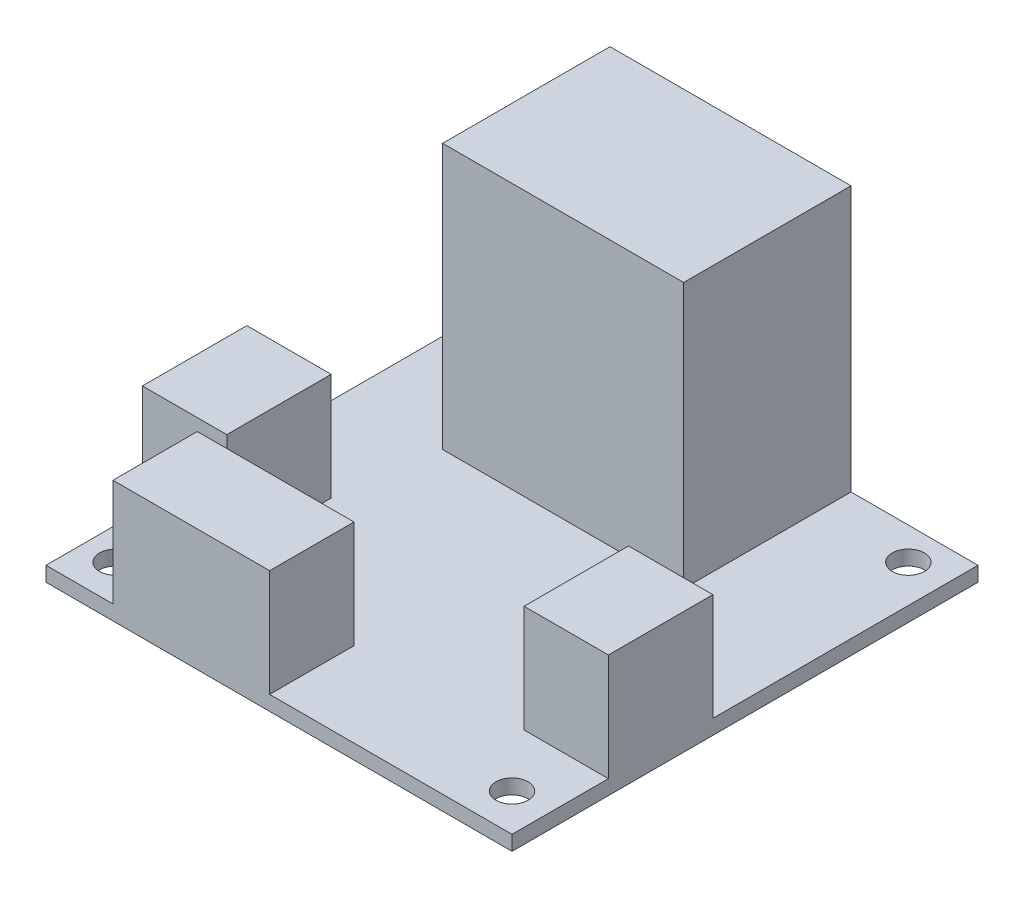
ISO-10303-21;
HEADER;
FILE_DESCRIPTION(('STEP AP214'),'2;1');
FILE_NAME('part.step','',(''),(''),'','','');
FILE_SCHEMA(('AUTOMOTIVE_DESIGN { 1 0 10303 214 1 1 1 1 }'));
ENDSEC;
DATA;
#1=APPLICATION_CONTEXT('core data for automotive mechanical design processes');
#2=APPLICATION_PROTOCOL_DEFINITION('international standard','automotive_design',2000,#1);
#3=PRODUCT_CONTEXT('',#1,'mechanical');
#4=PRODUCT('Part','Part','',(#3));
#5=PRODUCT_RELATED_PRODUCT_CATEGORY('part','',(#4));
#6=PRODUCT_DEFINITION_FORMATION('','',#4);
#7=PRODUCT_DEFINITION_CONTEXT('part definition',#1,'design');
#8=PRODUCT_DEFINITION('design','',#6,#7);
#9=PRODUCT_DEFINITION_SHAPE('','',#8);
#10=(LENGTH_UNIT() NAMED_UNIT(*) SI_UNIT(.MILLI.,.METRE.));
#11=(NAMED_UNIT(*) PLANE_ANGLE_UNIT() SI_UNIT($,.RADIAN.));
#12=(NAMED_UNIT(*) SI_UNIT($,.STERADIAN.) SOLID_ANGLE_UNIT());
#13=UNCERTAINTY_MEASURE_WITH_UNIT(LENGTH_MEASURE(1.E-05),#10,'distance_accuracy_value','');
#14=(GEOMETRIC_REPRESENTATION_CONTEXT(3) GLOBAL_UNCERTAINTY_ASSIGNED_CONTEXT((#13)) GLOBAL_UNIT_ASSIGNED_CONTEXT((#10,
#11,#12)) REPRESENTATION_CONTEXT('',''));
#15=CARTESIAN_POINT('',(0.,0.,0.));
#16=DIRECTION('',(0.,0.,1.));
#17=DIRECTION('',(1.,0.,0.));
#18=AXIS2_PLACEMENT_3D('',#15,#16,#17);
#19=CARTESIAN_POINT('',(0.,1.397,0.));
#20=DIRECTION('',(0.,-1.,0.));
#21=DIRECTION('',(0.,0.,-1.));
#22=AXIS2_PLACEMENT_3D('',#19,#20,#21);
#23=PLANE('',#22);
#24=CARTESIAN_POINT('',(3.048,1.397,-41.148));
#25=DIRECTION('',(0.,1.,0.));
#26=DIRECTION('',(0.,0.,1.));
#27=AXIS2_PLACEMENT_3D('',#24,#25,#26);
#28=CIRCLE('',#27,1.524);
#29=CARTESIAN_POINT('',(3.048,1.397,-39.624));
#30=VERTEX_POINT('',#29);
#31=EDGE_CURVE('E305',#30,#30,#28,.T.);
#32=ORIENTED_EDGE('',*,*,#31,.F.);
#33=EDGE_LOOP('',(#32));
#34=FACE_BOUND('',#33,.T.);
#35=CARTESIAN_POINT('',(40.64,1.397,-41.148));
#36=DIRECTION('',(0.,1.,0.));
#37=DIRECTION('',(0.,0.,1.));
#38=AXIS2_PLACEMENT_3D('',#35,#36,#37);
#39=CIRCLE('',#38,1.524);
#40=CARTESIAN_POINT('',(40.64,1.397,-39.624));
#41=VERTEX_POINT('',#40);
#42=EDGE_CURVE('E299',#41,#41,#39,.T.);
#43=ORIENTED_EDGE('',*,*,#42,.F.);
#44=EDGE_LOOP('',(#43));
#45=FACE_BOUND('',#44,.T.);
#46=CARTESIAN_POINT('',(40.6400000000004,1.397,-3.556));
#47=DIRECTION('',(0.,1.,0.));
#48=DIRECTION('',(0.,0.,1.));
#49=AXIS2_PLACEMENT_3D('',#46,#47,#48);
#50=CIRCLE('',#49,1.524);
#51=CARTESIAN_POINT('',(40.6400000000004,1.397,-2.032));
#52=VERTEX_POINT('',#51);
#53=EDGE_CURVE('E293',#52,#52,#50,.T.);
#54=ORIENTED_EDGE('',*,*,#53,.F.);
#55=EDGE_LOOP('',(#54));
#56=FACE_BOUND('',#55,.T.);
#57=CARTESIAN_POINT('',(3.04800000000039,1.397,-3.556));
#58=DIRECTION('',(0.,1.,0.));
#59=DIRECTION('',(0.,0.,1.));
#60=AXIS2_PLACEMENT_3D('',#57,#58,#59);
#61=CIRCLE('',#60,1.524);
#62=CARTESIAN_POINT('',(3.04800000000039,1.397,-2.032));
#63=VERTEX_POINT('',#62);
#64=EDGE_CURVE('E287',#63,#63,#61,.T.);
#65=ORIENTED_EDGE('',*,*,#64,.F.);
#66=EDGE_LOOP('',(#65));
#67=FACE_BOUND('',#66,.T.);
#68=DIRECTION('',(-1.,0.,0.));
#69=VECTOR('',#68,1.);
#70=CARTESIAN_POINT('',(44.196,1.397,-19.05));
#71=LINE('',#70,#69);
#72=CARTESIAN_POINT('',(44.196,1.397,-19.05));
#73=VERTEX_POINT('',#72);
#74=CARTESIAN_POINT('',(36.195,1.397,-19.05));
#75=VERTEX_POINT('',#74);
#76=EDGE_CURVE('E393',#73,#75,#71,.T.);
#77=ORIENTED_EDGE('',*,*,#76,.F.);
#78=DIRECTION('',(0.,0.,-1.));
#79=VECTOR('',#78,1.);
#80=CARTESIAN_POINT('',(44.196,1.397,0.));
#81=LINE('',#80,#79);
#82=CARTESIAN_POINT('',(44.196,1.397,-44.196));
#83=VERTEX_POINT('',#82);
#84=EDGE_CURVE('E190',#73,#83,#81,.T.);
#85=ORIENTED_EDGE('',*,*,#84,.T.);
#86=DIRECTION('',(-1.,0.,0.));
#87=VECTOR('',#86,1.);
#88=CARTESIAN_POINT('',(0.,1.397,-44.196));
#89=LINE('',#88,#87);
#90=CARTESIAN_POINT('',(32.1552964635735,1.397,-44.196));
#91=VERTEX_POINT('',#90);
#92=EDGE_CURVE('E320',#83,#91,#89,.T.);
#93=ORIENTED_EDGE('',*,*,#92,.T.);
#94=DIRECTION('',(0.,0.,-1.));
#95=VECTOR('',#94,1.);
#96=CARTESIAN_POINT('',(32.1552964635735,1.397,-44.196));
#97=LINE('',#96,#95);
#98=CARTESIAN_POINT('',(32.1552964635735,1.397,-28.321));
#99=VERTEX_POINT('',#98);
#100=EDGE_CURVE('E261',#99,#91,#97,.T.);
#101=ORIENTED_EDGE('',*,*,#100,.F.);
#102=DIRECTION('',(1.,0.,0.));
#103=VECTOR('',#102,1.);
#104=CARTESIAN_POINT('',(9.29529646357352,1.397,-28.321));
#105=LINE('',#104,#103);
#106=CARTESIAN_POINT('',(9.29529646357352,1.397,-28.321));
#107=VERTEX_POINT('',#106);
#108=EDGE_CURVE('E270',#107,#99,#105,.T.);
#109=ORIENTED_EDGE('',*,*,#108,.F.);
#110=DIRECTION('',(0.,0.,1.));
#111=VECTOR('',#110,1.);
#112=CARTESIAN_POINT('',(9.29529646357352,1.397,-44.196));
#113=LINE('',#112,#111);
#114=CARTESIAN_POINT('',(9.29529646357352,1.397,-44.196));
#115=VERTEX_POINT('',#114);
#116=EDGE_CURVE('E256',#115,#107,#113,.T.);
#117=ORIENTED_EDGE('',*,*,#116,.F.);
#118=CARTESIAN_POINT('',(0.,1.397,-44.196));
#119=VERTEX_POINT('',#118);
#120=EDGE_CURVE('E319',#115,#119,#89,.T.);
#121=ORIENTED_EDGE('',*,*,#120,.T.);
#122=DIRECTION('',(0.,0.,1.));
#123=VECTOR('',#122,1.);
#124=CARTESIAN_POINT('',(0.,1.397,0.));
#125=LINE('',#124,#123);
#126=CARTESIAN_POINT('',(0.,1.397,-19.05));
#127=VERTEX_POINT('',#126);
#128=EDGE_CURVE('E311',#119,#127,#125,.T.);
#129=ORIENTED_EDGE('',*,*,#128,.T.);
#130=DIRECTION('',(-1.,0.,0.));
#131=VECTOR('',#130,1.);
#132=CARTESIAN_POINT('',(0.,1.397,-19.05));
#133=LINE('',#132,#131);
#134=CARTESIAN_POINT('',(8.001,1.397,-19.05));
#135=VERTEX_POINT('',#134);
#136=EDGE_CURVE('E231',#135,#127,#133,.T.);
#137=ORIENTED_EDGE('',*,*,#136,.F.);
#138=DIRECTION('',(0.,0.,-1.));
#139=VECTOR('',#138,1.);
#140=CARTESIAN_POINT('',(8.001,1.397,-19.05));
#141=LINE('',#140,#139);
#142=CARTESIAN_POINT('',(8.001,1.397,-9.144));
#143=VERTEX_POINT('',#142);
#144=EDGE_CURVE('E240',#143,#135,#141,.T.);
#145=ORIENTED_EDGE('',*,*,#144,.F.);
#146=DIRECTION('',(1.,0.,0.));
#147=VECTOR('',#146,1.);
#148=CARTESIAN_POINT('',(0.,1.397,-9.144));
#149=LINE('',#148,#147);
#150=CARTESIAN_POINT('',(0.,1.397,-9.144));
#151=VERTEX_POINT('',#150);
#152=EDGE_CURVE('E226',#151,#143,#149,.T.);
#153=ORIENTED_EDGE('',*,*,#152,.F.);
#154=CARTESIAN_POINT('',(0.,1.397,0.));
#155=VERTEX_POINT('',#154);
#156=EDGE_CURVE('E314',#151,#155,#125,.T.);
#157=ORIENTED_EDGE('',*,*,#156,.T.);
#158=DIRECTION('',(1.,0.,0.));
#159=VECTOR('',#158,1.);
#160=CARTESIAN_POINT('',(0.,1.397,0.));
#161=LINE('',#160,#159);
#162=CARTESIAN_POINT('',(6.35,1.397,0.));
#163=VERTEX_POINT('',#162);
#164=EDGE_CURVE('E315',#155,#163,#161,.T.);
#165=ORIENTED_EDGE('',*,*,#164,.T.);
#166=DIRECTION('',(0.,0.,1.));
#167=VECTOR('',#166,1.);
#168=CARTESIAN_POINT('',(6.35,1.397,0.));
#169=LINE('',#168,#167);
#170=CARTESIAN_POINT('',(6.35,1.397,-8.001));
#171=VERTEX_POINT('',#170);
#172=EDGE_CURVE('E191',#171,#163,#169,.T.);
#173=ORIENTED_EDGE('',*,*,#172,.F.);
#174=DIRECTION('',(-1.,0.,0.));
#175=VECTOR('',#174,1.);
#176=CARTESIAN_POINT('',(6.35,1.397,-8.001));
#177=LINE('',#176,#175);
#178=CARTESIAN_POINT('',(21.209,1.397,-8.001));
#179=VERTEX_POINT('',#178);
#180=EDGE_CURVE('E204',#179,#171,#177,.T.);
#181=ORIENTED_EDGE('',*,*,#180,.F.);
#182=DIRECTION('',(0.,0.,-1.));
#183=VECTOR('',#182,1.);
#184=CARTESIAN_POINT('',(21.209,1.397,0.));
#185=LINE('',#184,#183);
#186=CARTESIAN_POINT('',(21.209,1.397,0.));
#187=VERTEX_POINT('',#186);
#188=EDGE_CURVE('E194',#187,#179,#185,.T.);
#189=ORIENTED_EDGE('',*,*,#188,.F.);
#190=CARTESIAN_POINT('',(44.196,1.397,0.));
#191=VERTEX_POINT('',#190);
#192=EDGE_CURVE('E313',#187,#191,#161,.T.);
#193=ORIENTED_EDGE('',*,*,#192,.T.);
#194=CARTESIAN_POINT('',(44.196,1.397,-9.144));
#195=VERTEX_POINT('',#194);
#196=EDGE_CURVE('E317',#191,#195,#81,.T.);
#197=ORIENTED_EDGE('',*,*,#196,.T.);
#198=DIRECTION('',(1.,0.,0.));
#199=VECTOR('',#198,1.);
#200=CARTESIAN_POINT('',(44.196,1.397,-9.144));
#201=LINE('',#200,#199);
#202=CARTESIAN_POINT('',(36.195,1.397,-9.144));
#203=VERTEX_POINT('',#202);
#204=EDGE_CURVE('E52',#203,#195,#201,.T.);
#205=ORIENTED_EDGE('',*,*,#204,.F.);
#206=DIRECTION('',(0.,0.,1.));
#207=VECTOR('',#206,1.);
#208=CARTESIAN_POINT('',(36.195,1.397,-9.144));
#209=LINE('',#208,#207);
#210=EDGE_CURVE('E47',#75,#203,#209,.T.);
#211=ORIENTED_EDGE('',*,*,#210,.F.);
#212=EDGE_LOOP('',(#77,#85,#93,#101,#109,#117,#121,#129,#137,#145,#153,#157,#165,#173,#181,#189,
#193,#197,#205,#211));
#213=FACE_BOUND('',#212,.T.);
#214=ADVANCED_FACE('F32',(#34,#45,#56,#67,#213),#23,.F.);
#215=CARTESIAN_POINT('',(0.,0.,0.));
#216=DIRECTION('',(0.,-1.,0.));
#217=DIRECTION('',(0.,0.,-1.));
#218=AXIS2_PLACEMENT_3D('',#215,#216,#217);
#219=PLANE('',#218);
#220=CARTESIAN_POINT('',(40.6400000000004,0.,-3.556));
#221=DIRECTION('',(0.,1.,0.));
#222=DIRECTION('',(0.,0.,1.));
#223=AXIS2_PLACEMENT_3D('',#220,#221,#222);
#224=CIRCLE('',#223,1.524);
#225=CARTESIAN_POINT('',(40.6400000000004,0.,-2.032));
#226=VERTEX_POINT('',#225);
#227=EDGE_CURVE('E290',#226,#226,#224,.T.);
#228=ORIENTED_EDGE('',*,*,#227,.T.);
#229=EDGE_LOOP('',(#228));
#230=FACE_BOUND('',#229,.T.);
#231=CARTESIAN_POINT('',(3.048,0.,-41.148));
#232=DIRECTION('',(0.,1.,0.));
#233=DIRECTION('',(0.,0.,1.));
#234=AXIS2_PLACEMENT_3D('',#231,#232,#233);
#235=CIRCLE('',#234,1.524);
#236=CARTESIAN_POINT('',(3.048,0.,-39.624));
#237=VERTEX_POINT('',#236);
#238=EDGE_CURVE('E302',#237,#237,#235,.T.);
#239=ORIENTED_EDGE('',*,*,#238,.T.);
#240=EDGE_LOOP('',(#239));
#241=FACE_BOUND('',#240,.T.);
#242=DIRECTION('',(0.,0.,1.));
#243=VECTOR('',#242,1.);
#244=CARTESIAN_POINT('',(0.,0.,0.));
#245=LINE('',#244,#243);
#246=CARTESIAN_POINT('',(0.,0.,-44.196));
#247=VERTEX_POINT('',#246);
#248=CARTESIAN_POINT('',(0.,0.,0.));
#249=VERTEX_POINT('',#248);
#250=EDGE_CURVE('E308',#247,#249,#245,.T.);
#251=ORIENTED_EDGE('',*,*,#250,.F.);
#252=DIRECTION('',(-1.,0.,0.));
#253=VECTOR('',#252,1.);
#254=CARTESIAN_POINT('',(0.,0.,-44.196));
#255=LINE('',#254,#253);
#256=CARTESIAN_POINT('',(44.196,0.,-44.196));
#257=VERTEX_POINT('',#256);
#258=EDGE_CURVE('E329',#257,#247,#255,.T.);
#259=ORIENTED_EDGE('',*,*,#258,.F.);
#260=DIRECTION('',(0.,0.,-1.));
#261=VECTOR('',#260,1.);
#262=CARTESIAN_POINT('',(44.196,0.,0.));
#263=LINE('',#262,#261);
#264=CARTESIAN_POINT('',(44.196,0.,0.));
#265=VERTEX_POINT('',#264);
#266=EDGE_CURVE('E327',#265,#257,#263,.T.);
#267=ORIENTED_EDGE('',*,*,#266,.F.);
#268=DIRECTION('',(1.,0.,0.));
#269=VECTOR('',#268,1.);
#270=CARTESIAN_POINT('',(0.,0.,0.));
#271=LINE('',#270,#269);
#272=EDGE_CURVE('E325',#249,#265,#271,.T.);
#273=ORIENTED_EDGE('',*,*,#272,.F.);
#274=EDGE_LOOP('',(#251,#259,#267,#273));
#275=FACE_BOUND('',#274,.T.);
#276=CARTESIAN_POINT('',(40.64,0.,-41.148));
#277=DIRECTION('',(0.,1.,0.));
#278=DIRECTION('',(0.,0.,1.));
#279=AXIS2_PLACEMENT_3D('',#276,#277,#278);
#280=CIRCLE('',#279,1.524);
#281=CARTESIAN_POINT('',(40.64,0.,-39.624));
#282=VERTEX_POINT('',#281);
#283=EDGE_CURVE('E296',#282,#282,#280,.T.);
#284=ORIENTED_EDGE('',*,*,#283,.T.);
#285=EDGE_LOOP('',(#284));
#286=FACE_BOUND('',#285,.T.);
#287=CARTESIAN_POINT('',(3.04800000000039,0.,-3.556));
#288=DIRECTION('',(0.,1.,0.));
#289=DIRECTION('',(0.,0.,1.));
#290=AXIS2_PLACEMENT_3D('',#287,#288,#289);
#291=CIRCLE('',#290,1.524);
#292=CARTESIAN_POINT('',(3.04800000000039,0.,-2.032));
#293=VERTEX_POINT('',#292);
#294=EDGE_CURVE('E286',#293,#293,#291,.T.);
#295=ORIENTED_EDGE('',*,*,#294,.T.);
#296=EDGE_LOOP('',(#295));
#297=FACE_BOUND('',#296,.T.);
#298=ADVANCED_FACE('F343',(#230,#241,#275,#286,#297),#219,.T.);
#299=CARTESIAN_POINT('',(0.,1.397,0.));
#300=DIRECTION('',(1.,0.,0.));
#301=DIRECTION('',(0.,0.,-1.));
#302=AXIS2_PLACEMENT_3D('',#299,#300,#301);
#303=PLANE('',#302);
#304=ORIENTED_EDGE('',*,*,#250,.T.);
#305=DIRECTION('',(0.,-1.,0.));
#306=VECTOR('',#305,1.);
#307=CARTESIAN_POINT('',(0.,1.397,0.));
#308=LINE('',#307,#306);
#309=EDGE_CURVE('E11',#155,#249,#308,.T.);
#310=ORIENTED_EDGE('',*,*,#309,.F.);
#311=ORIENTED_EDGE('',*,*,#156,.F.);
#312=DIRECTION('',(0.,-1.,0.));
#313=VECTOR('',#312,1.);
#314=CARTESIAN_POINT('',(0.,11.557,-9.144));
#315=LINE('',#314,#313);
#316=CARTESIAN_POINT('',(0.,11.557,-9.144));
#317=VERTEX_POINT('',#316);
#318=EDGE_CURVE('E253',#317,#151,#315,.T.);
#319=ORIENTED_EDGE('',*,*,#318,.F.);
#320=DIRECTION('',(0.,0.,1.));
#321=VECTOR('',#320,1.);
#322=CARTESIAN_POINT('',(0.,11.557,-19.05));
#323=LINE('',#322,#321);
#324=CARTESIAN_POINT('',(0.,11.557,-19.05));
#325=VERTEX_POINT('',#324);
#326=EDGE_CURVE('E227',#325,#317,#323,.T.);
#327=ORIENTED_EDGE('',*,*,#326,.F.);
#328=DIRECTION('',(0.,-1.,0.));
#329=VECTOR('',#328,1.);
#330=CARTESIAN_POINT('',(0.,11.557,-19.05));
#331=LINE('',#330,#329);
#332=EDGE_CURVE('E237',#325,#127,#331,.T.);
#333=ORIENTED_EDGE('',*,*,#332,.T.);
#334=ORIENTED_EDGE('',*,*,#128,.F.);
#335=DIRECTION('',(0.,-1.,0.));
#336=VECTOR('',#335,1.);
#337=CARTESIAN_POINT('',(0.,1.397,-44.196));
#338=LINE('',#337,#336);
#339=EDGE_CURVE('E322',#119,#247,#338,.T.);
#340=ORIENTED_EDGE('',*,*,#339,.T.);
#341=EDGE_LOOP('',(#304,#310,#311,#319,#327,#333,#334,#340));
#342=FACE_BOUND('',#341,.T.);
#343=ADVANCED_FACE('F34',(#342),#303,.F.);
#344=CARTESIAN_POINT('',(0.,1.397,0.));
#345=DIRECTION('',(0.,0.,-1.));
#346=DIRECTION('',(-1.,0.,0.));
#347=AXIS2_PLACEMENT_3D('',#344,#345,#346);
#348=PLANE('',#347);
#349=ORIENTED_EDGE('',*,*,#272,.T.);
#350=DIRECTION('',(0.,-1.,0.));
#351=VECTOR('',#350,1.);
#352=CARTESIAN_POINT('',(44.196,1.397,0.));
#353=LINE('',#352,#351);
#354=EDGE_CURVE('E40',#191,#265,#353,.T.);
#355=ORIENTED_EDGE('',*,*,#354,.F.);
#356=ORIENTED_EDGE('',*,*,#192,.F.);
#357=DIRECTION('',(0.,-1.,0.));
#358=VECTOR('',#357,1.);
#359=CARTESIAN_POINT('',(21.209,11.557,0.));
#360=LINE('',#359,#358);
#361=CARTESIAN_POINT('',(21.209,11.557,0.));
#362=VERTEX_POINT('',#361);
#363=EDGE_CURVE('E220',#362,#187,#360,.T.);
#364=ORIENTED_EDGE('',*,*,#363,.F.);
#365=DIRECTION('',(1.,0.,0.));
#366=VECTOR('',#365,1.);
#367=CARTESIAN_POINT('',(6.35,11.557,0.));
#368=LINE('',#367,#366);
#369=CARTESIAN_POINT('',(6.35,11.557,0.));
#370=VERTEX_POINT('',#369);
#371=EDGE_CURVE('E203',#370,#362,#368,.T.);
#372=ORIENTED_EDGE('',*,*,#371,.F.);
#373=DIRECTION('',(0.,-1.,0.));
#374=VECTOR('',#373,1.);
#375=CARTESIAN_POINT('',(6.35,11.557,0.));
#376=LINE('',#375,#374);
#377=EDGE_CURVE('E223',#370,#163,#376,.T.);
#378=ORIENTED_EDGE('',*,*,#377,.T.);
#379=ORIENTED_EDGE('',*,*,#164,.F.);
#380=ORIENTED_EDGE('',*,*,#309,.T.);
#381=EDGE_LOOP('',(#349,#355,#356,#364,#372,#378,#379,#380));
#382=FACE_BOUND('',#381,.T.);
#383=ADVANCED_FACE('F368',(#382),#348,.F.);
#384=CARTESIAN_POINT('',(44.196,1.397,0.));
#385=DIRECTION('',(-1.,0.,0.));
#386=DIRECTION('',(0.,0.,1.));
#387=AXIS2_PLACEMENT_3D('',#384,#385,#386);
#388=PLANE('',#387);
#389=ORIENTED_EDGE('',*,*,#266,.T.);
#390=DIRECTION('',(0.,-1.,0.));
#391=VECTOR('',#390,1.);
#392=CARTESIAN_POINT('',(44.196,1.397,-44.196));
#393=LINE('',#392,#391);
#394=EDGE_CURVE('E333',#83,#257,#393,.T.);
#395=ORIENTED_EDGE('',*,*,#394,.F.);
#396=ORIENTED_EDGE('',*,*,#84,.F.);
#397=DIRECTION('',(0.,-1.,0.));
#398=VECTOR('',#397,1.);
#399=CARTESIAN_POINT('',(44.196,11.557,-19.05));
#400=LINE('',#399,#398);
#401=CARTESIAN_POINT('',(44.196,11.557,-19.05));
#402=VERTEX_POINT('',#401);
#403=EDGE_CURVE('E172',#402,#73,#400,.T.);
#404=ORIENTED_EDGE('',*,*,#403,.F.);
#405=DIRECTION('',(0.,0.,-1.));
#406=VECTOR('',#405,1.);
#407=CARTESIAN_POINT('',(44.196,11.557,-9.144));
#408=LINE('',#407,#406);
#409=CARTESIAN_POINT('',(44.196,11.557,-9.144));
#410=VERTEX_POINT('',#409);
#411=EDGE_CURVE('E178',#410,#402,#408,.T.);
#412=ORIENTED_EDGE('',*,*,#411,.F.);
#413=DIRECTION('',(0.,-1.,0.));
#414=VECTOR('',#413,1.);
#415=CARTESIAN_POINT('',(44.196,11.557,-9.144));
#416=LINE('',#415,#414);
#417=EDGE_CURVE('E386',#410,#195,#416,.T.);
#418=ORIENTED_EDGE('',*,*,#417,.T.);
#419=ORIENTED_EDGE('',*,*,#196,.F.);
#420=ORIENTED_EDGE('',*,*,#354,.T.);
#421=EDGE_LOOP('',(#389,#395,#396,#404,#412,#418,#419,#420));
#422=FACE_BOUND('',#421,.T.);
#423=ADVANCED_FACE('F188',(#422),#388,.F.);
#424=CARTESIAN_POINT('',(0.,1.397,-44.196));
#425=DIRECTION('',(0.,0.,1.));
#426=DIRECTION('',(1.,0.,0.));
#427=AXIS2_PLACEMENT_3D('',#424,#425,#426);
#428=PLANE('',#427);
#429=ORIENTED_EDGE('',*,*,#258,.T.);
#430=ORIENTED_EDGE('',*,*,#339,.F.);
#431=ORIENTED_EDGE('',*,*,#120,.F.);
#432=DIRECTION('',(0.,-1.,0.));
#433=VECTOR('',#432,1.);
#434=CARTESIAN_POINT('',(9.29529646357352,26.543,-44.196));
#435=LINE('',#434,#433);
#436=CARTESIAN_POINT('',(9.29529646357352,26.543,-44.196));
#437=VERTEX_POINT('',#436);
#438=EDGE_CURVE('E267',#437,#115,#435,.T.);
#439=ORIENTED_EDGE('',*,*,#438,.F.);
#440=DIRECTION('',(-1.,0.,0.));
#441=VECTOR('',#440,1.);
#442=CARTESIAN_POINT('',(9.29529646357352,26.543,-44.196));
#443=LINE('',#442,#441);
#444=CARTESIAN_POINT('',(32.1552964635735,26.543,-44.196));
#445=VERTEX_POINT('',#444);
#446=EDGE_CURVE('E265',#445,#437,#443,.T.);
#447=ORIENTED_EDGE('',*,*,#446,.F.);
#448=DIRECTION('',(0.,-1.,0.));
#449=VECTOR('',#448,1.);
#450=CARTESIAN_POINT('',(32.1552964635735,26.543,-44.196));
#451=LINE('',#450,#449);
#452=EDGE_CURVE('E277',#445,#91,#451,.T.);
#453=ORIENTED_EDGE('',*,*,#452,.T.);
#454=ORIENTED_EDGE('',*,*,#92,.F.);
#455=ORIENTED_EDGE('',*,*,#394,.T.);
#456=EDGE_LOOP('',(#429,#430,#431,#439,#447,#453,#454,#455));
#457=FACE_BOUND('',#456,.T.);
#458=ADVANCED_FACE('F347',(#457),#428,.F.);
#459=CARTESIAN_POINT('',(3.048,1.397,-41.148));
#460=DIRECTION('',(0.,-1.,0.));
#461=DIRECTION('',(0.,0.,-1.));
#462=AXIS2_PLACEMENT_3D('',#459,#460,#461);
#463=CYLINDRICAL_SURFACE('',#462,1.524);
#464=ORIENTED_EDGE('',*,*,#31,.T.);
#465=EDGE_LOOP('',(#464));
#466=FACE_BOUND('',#465,.T.);
#467=ORIENTED_EDGE('',*,*,#238,.F.);
#468=EDGE_LOOP('',(#467));
#469=FACE_BOUND('',#468,.T.);
#470=ADVANCED_FACE('F417',(#466,#469),#463,.F.);
#471=CARTESIAN_POINT('',(40.64,1.397,-41.148));
#472=DIRECTION('',(0.,-1.,0.));
#473=DIRECTION('',(0.,0.,-1.));
#474=AXIS2_PLACEMENT_3D('',#471,#472,#473);
#475=CYLINDRICAL_SURFACE('',#474,1.524);
#476=ORIENTED_EDGE('',*,*,#42,.T.);
#477=EDGE_LOOP('',(#476));
#478=FACE_BOUND('',#477,.T.);
#479=ORIENTED_EDGE('',*,*,#283,.F.);
#480=EDGE_LOOP('',(#479));
#481=FACE_BOUND('',#480,.T.);
#482=ADVANCED_FACE('F443',(#478,#481),#475,.F.);
#483=CARTESIAN_POINT('',(40.6400000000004,1.397,-3.556));
#484=DIRECTION('',(0.,-1.,0.));
#485=DIRECTION('',(0.,0.,-1.));
#486=AXIS2_PLACEMENT_3D('',#483,#484,#485);
#487=CYLINDRICAL_SURFACE('',#486,1.524);
#488=ORIENTED_EDGE('',*,*,#53,.T.);
#489=EDGE_LOOP('',(#488));
#490=FACE_BOUND('',#489,.T.);
#491=ORIENTED_EDGE('',*,*,#227,.F.);
#492=EDGE_LOOP('',(#491));
#493=FACE_BOUND('',#492,.T.);
#494=ADVANCED_FACE('F453',(#490,#493),#487,.F.);
#495=CARTESIAN_POINT('',(3.04800000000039,1.397,-3.556));
#496=DIRECTION('',(0.,-1.,0.));
#497=DIRECTION('',(0.,0.,-1.));
#498=AXIS2_PLACEMENT_3D('',#495,#496,#497);
#499=CYLINDRICAL_SURFACE('',#498,1.524);
#500=ORIENTED_EDGE('',*,*,#64,.T.);
#501=EDGE_LOOP('',(#500));
#502=FACE_BOUND('',#501,.T.);
#503=ORIENTED_EDGE('',*,*,#294,.F.);
#504=EDGE_LOOP('',(#503));
#505=FACE_BOUND('',#504,.T.);
#506=ADVANCED_FACE('F462',(#502,#505),#499,.F.);
#507=CARTESIAN_POINT('',(9.29529646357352,26.543,-44.196));
#508=DIRECTION('',(1.,0.,0.));
#509=DIRECTION('',(0.,0.,-1.));
#510=AXIS2_PLACEMENT_3D('',#507,#508,#509);
#511=PLANE('',#510);
#512=ORIENTED_EDGE('',*,*,#116,.T.);
#513=DIRECTION('',(0.,-1.,0.));
#514=VECTOR('',#513,1.);
#515=CARTESIAN_POINT('',(9.29529646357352,26.543,-28.321));
#516=LINE('',#515,#514);
#517=CARTESIAN_POINT('',(9.29529646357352,26.543,-28.321));
#518=VERTEX_POINT('',#517);
#519=EDGE_CURVE('E283',#518,#107,#516,.T.);
#520=ORIENTED_EDGE('',*,*,#519,.F.);
#521=DIRECTION('',(0.,0.,1.));
#522=VECTOR('',#521,1.);
#523=CARTESIAN_POINT('',(9.29529646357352,26.543,-44.196));
#524=LINE('',#523,#522);
#525=EDGE_CURVE('E257',#437,#518,#524,.T.);
#526=ORIENTED_EDGE('',*,*,#525,.F.);
#527=ORIENTED_EDGE('',*,*,#438,.T.);
#528=EDGE_LOOP('',(#512,#520,#526,#527));
#529=FACE_BOUND('',#528,.T.);
#530=ADVANCED_FACE('F472',(#529),#511,.F.);
#531=CARTESIAN_POINT('',(9.29529646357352,26.543,-28.321));
#532=DIRECTION('',(0.,0.,-1.));
#533=DIRECTION('',(-1.,0.,0.));
#534=AXIS2_PLACEMENT_3D('',#531,#532,#533);
#535=PLANE('',#534);
#536=ORIENTED_EDGE('',*,*,#108,.T.);
#537=DIRECTION('',(0.,-1.,0.));
#538=VECTOR('',#537,1.);
#539=CARTESIAN_POINT('',(32.1552964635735,26.543,-28.321));
#540=LINE('',#539,#538);
#541=CARTESIAN_POINT('',(32.1552964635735,26.543,-28.321));
#542=VERTEX_POINT('',#541);
#543=EDGE_CURVE('E280',#542,#99,#540,.T.);
#544=ORIENTED_EDGE('',*,*,#543,.F.);
#545=DIRECTION('',(1.,0.,0.));
#546=VECTOR('',#545,1.);
#547=CARTESIAN_POINT('',(9.29529646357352,26.543,-28.321));
#548=LINE('',#547,#546);
#549=EDGE_CURVE('E260',#518,#542,#548,.T.);
#550=ORIENTED_EDGE('',*,*,#549,.F.);
#551=ORIENTED_EDGE('',*,*,#519,.T.);
#552=EDGE_LOOP('',(#536,#544,#550,#551));
#553=FACE_BOUND('',#552,.T.);
#554=ADVANCED_FACE('F488',(#553),#535,.F.);
#555=CARTESIAN_POINT('',(32.1552964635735,26.543,-44.196));
#556=DIRECTION('',(-1.,0.,0.));
#557=DIRECTION('',(0.,0.,1.));
#558=AXIS2_PLACEMENT_3D('',#555,#556,#557);
#559=PLANE('',#558);
#560=ORIENTED_EDGE('',*,*,#100,.T.);
#561=ORIENTED_EDGE('',*,*,#452,.F.);
#562=DIRECTION('',(0.,0.,-1.));
#563=VECTOR('',#562,1.);
#564=CARTESIAN_POINT('',(32.1552964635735,26.543,-44.196));
#565=LINE('',#564,#563);
#566=EDGE_CURVE('E263',#542,#445,#565,.T.);
#567=ORIENTED_EDGE('',*,*,#566,.F.);
#568=ORIENTED_EDGE('',*,*,#543,.T.);
#569=EDGE_LOOP('',(#560,#561,#567,#568));
#570=FACE_BOUND('',#569,.T.);
#571=ADVANCED_FACE('F498',(#570),#559,.F.);
#572=CARTESIAN_POINT('',(0.,26.543,0.));
#573=DIRECTION('',(0.,1.,0.));
#574=DIRECTION('',(0.,0.,1.));
#575=AXIS2_PLACEMENT_3D('',#572,#573,#574);
#576=PLANE('',#575);
#577=ORIENTED_EDGE('',*,*,#525,.T.);
#578=ORIENTED_EDGE('',*,*,#549,.T.);
#579=ORIENTED_EDGE('',*,*,#566,.T.);
#580=ORIENTED_EDGE('',*,*,#446,.T.);
#581=EDGE_LOOP('',(#577,#578,#579,#580));
#582=FACE_BOUND('',#581,.T.);
#583=ADVANCED_FACE('F508',(#582),#576,.T.);
#584=CARTESIAN_POINT('',(0.,11.557,-9.144));
#585=DIRECTION('',(0.,0.,-1.));
#586=DIRECTION('',(-1.,0.,0.));
#587=AXIS2_PLACEMENT_3D('',#584,#585,#586);
#588=PLANE('',#587);
#589=ORIENTED_EDGE('',*,*,#152,.T.);
#590=DIRECTION('',(0.,-1.,0.));
#591=VECTOR('',#590,1.);
#592=CARTESIAN_POINT('',(8.001,11.557,-9.144));
#593=LINE('',#592,#591);
#594=CARTESIAN_POINT('',(8.001,11.557,-9.144));
#595=VERTEX_POINT('',#594);
#596=EDGE_CURVE('E250',#595,#143,#593,.T.);
#597=ORIENTED_EDGE('',*,*,#596,.F.);
#598=DIRECTION('',(1.,0.,0.));
#599=VECTOR('',#598,1.);
#600=CARTESIAN_POINT('',(0.,11.557,-9.144));
#601=LINE('',#600,#599);
#602=EDGE_CURVE('E230',#317,#595,#601,.T.);
#603=ORIENTED_EDGE('',*,*,#602,.F.);
#604=ORIENTED_EDGE('',*,*,#318,.T.);
#605=EDGE_LOOP('',(#589,#597,#603,#604));
#606=FACE_BOUND('',#605,.T.);
#607=ADVANCED_FACE('F365',(#606),#588,.F.);
#608=CARTESIAN_POINT('',(8.001,11.557,-19.05));
#609=DIRECTION('',(-1.,0.,0.));
#610=DIRECTION('',(0.,0.,1.));
#611=AXIS2_PLACEMENT_3D('',#608,#609,#610);
#612=PLANE('',#611);
#613=ORIENTED_EDGE('',*,*,#144,.T.);
#614=DIRECTION('',(0.,-1.,0.));
#615=VECTOR('',#614,1.);
#616=CARTESIAN_POINT('',(8.001,11.557,-19.05));
#617=LINE('',#616,#615);
#618=CARTESIAN_POINT('',(8.001,11.557,-19.05));
#619=VERTEX_POINT('',#618);
#620=EDGE_CURVE('E247',#619,#135,#617,.T.);
#621=ORIENTED_EDGE('',*,*,#620,.F.);
#622=DIRECTION('',(0.,0.,-1.));
#623=VECTOR('',#622,1.);
#624=CARTESIAN_POINT('',(8.001,11.557,-19.05));
#625=LINE('',#624,#623);
#626=EDGE_CURVE('E233',#595,#619,#625,.T.);
#627=ORIENTED_EDGE('',*,*,#626,.F.);
#628=ORIENTED_EDGE('',*,*,#596,.T.);
#629=EDGE_LOOP('',(#613,#621,#627,#628));
#630=FACE_BOUND('',#629,.T.);
#631=ADVANCED_FACE('F361',(#630),#612,.F.);
#632=CARTESIAN_POINT('',(0.,11.557,-19.05));
#633=DIRECTION('',(0.,0.,1.));
#634=DIRECTION('',(1.,0.,0.));
#635=AXIS2_PLACEMENT_3D('',#632,#633,#634);
#636=PLANE('',#635);
#637=ORIENTED_EDGE('',*,*,#136,.T.);
#638=ORIENTED_EDGE('',*,*,#332,.F.);
#639=DIRECTION('',(-1.,0.,0.));
#640=VECTOR('',#639,1.);
#641=CARTESIAN_POINT('',(0.,11.557,-19.05));
#642=LINE('',#641,#640);
#643=EDGE_CURVE('E235',#619,#325,#642,.T.);
#644=ORIENTED_EDGE('',*,*,#643,.F.);
#645=ORIENTED_EDGE('',*,*,#620,.T.);
#646=EDGE_LOOP('',(#637,#638,#644,#645));
#647=FACE_BOUND('',#646,.T.);
#648=ADVANCED_FACE('F356',(#647),#636,.F.);
#649=CARTESIAN_POINT('',(0.,11.557,0.));
#650=DIRECTION('',(0.,1.,0.));
#651=DIRECTION('',(0.,0.,1.));
#652=AXIS2_PLACEMENT_3D('',#649,#650,#651);
#653=PLANE('',#652);
#654=ORIENTED_EDGE('',*,*,#326,.T.);
#655=ORIENTED_EDGE('',*,*,#602,.T.);
#656=ORIENTED_EDGE('',*,*,#626,.T.);
#657=ORIENTED_EDGE('',*,*,#643,.T.);
#658=EDGE_LOOP('',(#654,#655,#656,#657));
#659=FACE_BOUND('',#658,.T.);
#660=ADVANCED_FACE('F565',(#659),#653,.T.);
#661=CARTESIAN_POINT('',(6.35,11.557,0.));
#662=DIRECTION('',(1.,0.,0.));
#663=DIRECTION('',(0.,0.,-1.));
#664=AXIS2_PLACEMENT_3D('',#661,#662,#663);
#665=PLANE('',#664);
#666=ORIENTED_EDGE('',*,*,#172,.T.);
#667=ORIENTED_EDGE('',*,*,#377,.F.);
#668=DIRECTION('',(0.,0.,1.));
#669=VECTOR('',#668,1.);
#670=CARTESIAN_POINT('',(6.35,11.557,0.));
#671=LINE('',#670,#669);
#672=CARTESIAN_POINT('',(6.35,11.557,-8.001));
#673=VERTEX_POINT('',#672);
#674=EDGE_CURVE('E200',#673,#370,#671,.T.);
#675=ORIENTED_EDGE('',*,*,#674,.F.);
#676=DIRECTION('',(0.,-1.,0.));
#677=VECTOR('',#676,1.);
#678=CARTESIAN_POINT('',(6.35,11.557,-8.001));
#679=LINE('',#678,#677);
#680=EDGE_CURVE('E209',#673,#171,#679,.T.);
#681=ORIENTED_EDGE('',*,*,#680,.T.);
#682=EDGE_LOOP('',(#666,#667,#675,#681));
#683=FACE_BOUND('',#682,.T.);
#684=ADVANCED_FACE('F373',(#683),#665,.F.);
#685=CARTESIAN_POINT('',(21.209,11.557,0.));
#686=DIRECTION('',(-1.,0.,0.));
#687=DIRECTION('',(0.,0.,1.));
#688=AXIS2_PLACEMENT_3D('',#685,#686,#687);
#689=PLANE('',#688);
#690=ORIENTED_EDGE('',*,*,#188,.T.);
#691=DIRECTION('',(0.,-1.,0.));
#692=VECTOR('',#691,1.);
#693=CARTESIAN_POINT('',(21.209,11.557,-8.001));
#694=LINE('',#693,#692);
#695=CARTESIAN_POINT('',(21.209,11.557,-8.001));
#696=VERTEX_POINT('',#695);
#697=EDGE_CURVE('E217',#696,#179,#694,.T.);
#698=ORIENTED_EDGE('',*,*,#697,.F.);
#699=DIRECTION('',(0.,0.,-1.));
#700=VECTOR('',#699,1.);
#701=CARTESIAN_POINT('',(21.209,11.557,0.));
#702=LINE('',#701,#700);
#703=EDGE_CURVE('E206',#362,#696,#702,.T.);
#704=ORIENTED_EDGE('',*,*,#703,.F.);
#705=ORIENTED_EDGE('',*,*,#363,.T.);
#706=EDGE_LOOP('',(#690,#698,#704,#705));
#707=FACE_BOUND('',#706,.T.);
#708=ADVANCED_FACE('F382',(#707),#689,.F.);
#709=CARTESIAN_POINT('',(6.35,11.557,-8.001));
#710=DIRECTION('',(0.,0.,1.));
#711=DIRECTION('',(1.,0.,0.));
#712=AXIS2_PLACEMENT_3D('',#709,#710,#711);
#713=PLANE('',#712);
#714=ORIENTED_EDGE('',*,*,#180,.T.);
#715=ORIENTED_EDGE('',*,*,#680,.F.);
#716=DIRECTION('',(-1.,0.,0.));
#717=VECTOR('',#716,1.);
#718=CARTESIAN_POINT('',(6.35,11.557,-8.001));
#719=LINE('',#718,#717);
#720=EDGE_CURVE('E208',#696,#673,#719,.T.);
#721=ORIENTED_EDGE('',*,*,#720,.F.);
#722=ORIENTED_EDGE('',*,*,#697,.T.);
#723=EDGE_LOOP('',(#714,#715,#721,#722));
#724=FACE_BOUND('',#723,.T.);
#725=ADVANCED_FACE('F377',(#724),#713,.F.);
#726=CARTESIAN_POINT('',(0.,11.557,0.));
#727=DIRECTION('',(0.,-1.,0.));
#728=DIRECTION('',(0.,0.,-1.));
#729=AXIS2_PLACEMENT_3D('',#726,#727,#728);
#730=PLANE('',#729);
#731=ORIENTED_EDGE('',*,*,#674,.T.);
#732=ORIENTED_EDGE('',*,*,#371,.T.);
#733=ORIENTED_EDGE('',*,*,#703,.T.);
#734=ORIENTED_EDGE('',*,*,#720,.T.);
#735=EDGE_LOOP('',(#731,#732,#733,#734));
#736=FACE_BOUND('',#735,.T.);
#737=ADVANCED_FACE('F404',(#736),#730,.F.);
#738=CARTESIAN_POINT('',(44.196,11.557,-19.05));
#739=DIRECTION('',(0.,0.,1.));
#740=DIRECTION('',(1.,0.,0.));
#741=AXIS2_PLACEMENT_3D('',#738,#739,#740);
#742=PLANE('',#741);
#743=ORIENTED_EDGE('',*,*,#76,.T.);
#744=DIRECTION('',(0.,-1.,0.));
#745=VECTOR('',#744,1.);
#746=CARTESIAN_POINT('',(36.195,11.557,-19.05));
#747=LINE('',#746,#745);
#748=CARTESIAN_POINT('',(36.195,11.557,-19.05));
#749=VERTEX_POINT('',#748);
#750=EDGE_CURVE('E174',#749,#75,#747,.T.);
#751=ORIENTED_EDGE('',*,*,#750,.F.);
#752=DIRECTION('',(-1.,0.,0.));
#753=VECTOR('',#752,1.);
#754=CARTESIAN_POINT('',(44.196,11.557,-19.05));
#755=LINE('',#754,#753);
#756=EDGE_CURVE('E168',#402,#749,#755,.T.);
#757=ORIENTED_EDGE('',*,*,#756,.F.);
#758=ORIENTED_EDGE('',*,*,#403,.T.);
#759=EDGE_LOOP('',(#743,#751,#757,#758));
#760=FACE_BOUND('',#759,.T.);
#761=ADVANCED_FACE('F170',(#760),#742,.F.);
#762=CARTESIAN_POINT('',(36.195,11.557,-9.144));
#763=DIRECTION('',(1.,0.,0.));
#764=DIRECTION('',(0.,0.,-1.));
#765=AXIS2_PLACEMENT_3D('',#762,#763,#764);
#766=PLANE('',#765);
#767=ORIENTED_EDGE('',*,*,#210,.T.);
#768=DIRECTION('',(0.,-1.,0.));
#769=VECTOR('',#768,1.);
#770=CARTESIAN_POINT('',(36.195,11.557,-9.144));
#771=LINE('',#770,#769);
#772=CARTESIAN_POINT('',(36.195,11.557,-9.144));
#773=VERTEX_POINT('',#772);
#774=EDGE_CURVE('E196',#773,#203,#771,.T.);
#775=ORIENTED_EDGE('',*,*,#774,.F.);
#776=DIRECTION('',(0.,0.,1.));
#777=VECTOR('',#776,1.);
#778=CARTESIAN_POINT('',(36.195,11.557,-9.144));
#779=LINE('',#778,#777);
#780=EDGE_CURVE('E177',#749,#773,#779,.T.);
#781=ORIENTED_EDGE('',*,*,#780,.F.);
#782=ORIENTED_EDGE('',*,*,#750,.T.);
#783=EDGE_LOOP('',(#767,#775,#781,#782));
#784=FACE_BOUND('',#783,.T.);
#785=ADVANCED_FACE('F396',(#784),#766,.F.);
#786=CARTESIAN_POINT('',(44.196,11.557,-9.144));
#787=DIRECTION('',(0.,0.,-1.));
#788=DIRECTION('',(-1.,0.,0.));
#789=AXIS2_PLACEMENT_3D('',#786,#787,#788);
#790=PLANE('',#789);
#791=ORIENTED_EDGE('',*,*,#204,.T.);
#792=ORIENTED_EDGE('',*,*,#417,.F.);
#793=DIRECTION('',(1.,0.,0.));
#794=VECTOR('',#793,1.);
#795=CARTESIAN_POINT('',(44.196,11.557,-9.144));
#796=LINE('',#795,#794);
#797=EDGE_CURVE('E183',#773,#410,#796,.T.);
#798=ORIENTED_EDGE('',*,*,#797,.F.);
#799=ORIENTED_EDGE('',*,*,#774,.T.);
#800=EDGE_LOOP('',(#791,#792,#798,#799));
#801=FACE_BOUND('',#800,.T.);
#802=ADVANCED_FACE('F385',(#801),#790,.F.);
#803=CARTESIAN_POINT('',(0.,11.557,0.));
#804=DIRECTION('',(0.,1.,0.));
#805=DIRECTION('',(0.,0.,1.));
#806=AXIS2_PLACEMENT_3D('',#803,#804,#805);
#807=PLANE('',#806);
#808=ORIENTED_EDGE('',*,*,#411,.T.);
#809=ORIENTED_EDGE('',*,*,#756,.T.);
#810=ORIENTED_EDGE('',*,*,#780,.T.);
#811=ORIENTED_EDGE('',*,*,#797,.T.);
#812=EDGE_LOOP('',(#808,#809,#810,#811));
#813=FACE_BOUND('',#812,.T.);
#814=ADVANCED_FACE('F181',(#813),#807,.T.);
#815=CLOSED_SHELL('',(#214,#298,#343,#383,#423,#458,#470,#482,#494,#506,#530,#554,#571,#583,
#607,#631,#648,#660,#684,#708,#725,#737,#761,#785,#802,#814));
#816=MANIFOLD_SOLID_BREP('B2',#815);
#817=ADVANCED_BREP_SHAPE_REPRESENTATION('',(#18,#816),#14);
#818=SHAPE_DEFINITION_REPRESENTATION(#9,#817);
ENDSEC;
END-ISO-10303-21;
